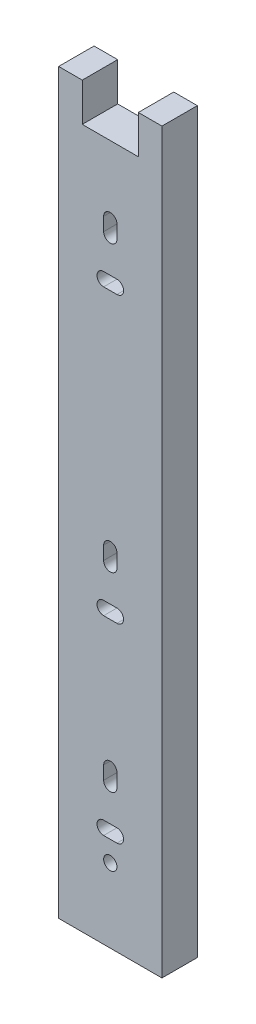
ISO-10303-21;
HEADER;
FILE_DESCRIPTION(('STEP AP214'),'2;1');
FILE_NAME('part.step','',(''),(''),'','','');
FILE_SCHEMA(('AUTOMOTIVE_DESIGN { 1 0 10303 214 1 1 1 1 }'));
ENDSEC;
DATA;
#1=APPLICATION_CONTEXT('core data for automotive mechanical design processes');
#2=APPLICATION_PROTOCOL_DEFINITION('international standard','automotive_design',2000,#1);
#3=PRODUCT_CONTEXT('',#1,'mechanical');
#4=PRODUCT('Part','Part','',(#3));
#5=PRODUCT_RELATED_PRODUCT_CATEGORY('part','',(#4));
#6=PRODUCT_DEFINITION_FORMATION('','',#4);
#7=PRODUCT_DEFINITION_CONTEXT('part definition',#1,'design');
#8=PRODUCT_DEFINITION('design','',#6,#7);
#9=PRODUCT_DEFINITION_SHAPE('','',#8);
#10=(LENGTH_UNIT() NAMED_UNIT(*) SI_UNIT(.MILLI.,.METRE.));
#11=(NAMED_UNIT(*) PLANE_ANGLE_UNIT() SI_UNIT($,.RADIAN.));
#12=(NAMED_UNIT(*) SI_UNIT($,.STERADIAN.) SOLID_ANGLE_UNIT());
#13=UNCERTAINTY_MEASURE_WITH_UNIT(LENGTH_MEASURE(1.E-05),#10,'distance_accuracy_value','');
#14=(GEOMETRIC_REPRESENTATION_CONTEXT(3) GLOBAL_UNCERTAINTY_ASSIGNED_CONTEXT((#13)) GLOBAL_UNIT_ASSIGNED_CONTEXT((#10,
#11,#12)) REPRESENTATION_CONTEXT('',''));
#15=CARTESIAN_POINT('',(0.,0.,0.));
#16=DIRECTION('',(0.,0.,1.));
#17=DIRECTION('',(1.,0.,0.));
#18=AXIS2_PLACEMENT_3D('',#15,#16,#17);
#19=CARTESIAN_POINT('',(-20.4494382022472,228.436329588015,12.));
#20=DIRECTION('',(0.,-1.,0.));
#21=DIRECTION('',(0.,0.,-1.));
#22=AXIS2_PLACEMENT_3D('',#19,#20,#21);
#23=PLANE('',#22);
#24=DIRECTION('',(0.,0.,-1.));
#25=VECTOR('',#24,1.);
#26=CARTESIAN_POINT('',(-12.4494382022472,228.436329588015,25.));
#27=LINE('',#26,#25);
#28=CARTESIAN_POINT('',(-12.4494382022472,228.436329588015,12.));
#29=VERTEX_POINT('',#28);
#30=CARTESIAN_POINT('',(-12.4494382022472,228.436329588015,0.));
#31=VERTEX_POINT('',#30);
#32=EDGE_CURVE('E385',#29,#31,#27,.T.);
#33=ORIENTED_EDGE('',*,*,#32,.T.);
#34=DIRECTION('',(-1.,0.,0.));
#35=VECTOR('',#34,1.);
#36=CARTESIAN_POINT('',(-20.4494382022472,228.436329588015,0.));
#37=LINE('',#36,#35);
#38=CARTESIAN_POINT('',(-20.4494382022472,228.436329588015,0.));
#39=VERTEX_POINT('',#38);
#40=EDGE_CURVE('E423',#31,#39,#37,.T.);
#41=ORIENTED_EDGE('',*,*,#40,.T.);
#42=DIRECTION('',(0.,0.,-1.));
#43=VECTOR('',#42,1.);
#44=CARTESIAN_POINT('',(-20.4494382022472,228.436329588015,12.));
#45=LINE('',#44,#43);
#46=CARTESIAN_POINT('',(-20.4494382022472,228.436329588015,12.));
#47=VERTEX_POINT('',#46);
#48=EDGE_CURVE('E416',#47,#39,#45,.T.);
#49=ORIENTED_EDGE('',*,*,#48,.F.);
#50=DIRECTION('',(-1.,0.,0.));
#51=VECTOR('',#50,1.);
#52=CARTESIAN_POINT('',(-20.4494382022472,228.436329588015,12.));
#53=LINE('',#52,#51);
#54=EDGE_CURVE('E412',#29,#47,#53,.T.);
#55=ORIENTED_EDGE('',*,*,#54,.F.);
#56=EDGE_LOOP('',(#33,#41,#49,#55));
#57=FACE_BOUND('',#56,.T.);
#58=ADVANCED_FACE('F32',(#57),#23,.F.);
#59=DIRECTION('',(0.,0.,-1.));
#60=VECTOR('',#59,1.);
#61=CARTESIAN_POINT('',(6.5505617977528,228.436329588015,25.));
#62=LINE('',#61,#60);
#63=CARTESIAN_POINT('',(6.5505617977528,228.436329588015,12.));
#64=VERTEX_POINT('',#63);
#65=CARTESIAN_POINT('',(6.5505617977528,228.436329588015,0.));
#66=VERTEX_POINT('',#65);
#67=EDGE_CURVE('E388',#64,#66,#62,.T.);
#68=ORIENTED_EDGE('',*,*,#67,.F.);
#69=CARTESIAN_POINT('',(14.5505617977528,228.436329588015,12.));
#70=VERTEX_POINT('',#69);
#71=EDGE_CURVE('E413',#70,#64,#53,.T.);
#72=ORIENTED_EDGE('',*,*,#71,.F.);
#73=DIRECTION('',(0.,0.,-1.));
#74=VECTOR('',#73,1.);
#75=CARTESIAN_POINT('',(14.5505617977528,228.436329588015,12.));
#76=LINE('',#75,#74);
#77=CARTESIAN_POINT('',(14.5505617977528,228.436329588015,0.));
#78=VERTEX_POINT('',#77);
#79=EDGE_CURVE('E428',#70,#78,#76,.T.);
#80=ORIENTED_EDGE('',*,*,#79,.T.);
#81=EDGE_CURVE('E408',#78,#66,#37,.T.);
#82=ORIENTED_EDGE('',*,*,#81,.T.);
#83=EDGE_LOOP('',(#68,#72,#80,#82));
#84=FACE_BOUND('',#83,.T.);
#85=ADVANCED_FACE('F523',(#84),#23,.F.);
#86=CARTESIAN_POINT('',(0.,0.,12.));
#87=DIRECTION('',(0.,0.,1.));
#88=DIRECTION('',(1.,0.,0.));
#89=AXIS2_PLACEMENT_3D('',#86,#87,#88);
#90=PLANE('',#89);
#91=CARTESIAN_POINT('',(-5.1994382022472,12.636329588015,12.));
#92=DIRECTION('',(0.,0.,1.));
#93=DIRECTION('',(1.,0.,0.));
#94=AXIS2_PLACEMENT_3D('',#91,#92,#93);
#95=CIRCLE('',#94,2.25);
#96=CARTESIAN_POINT('',(-5.1994382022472,14.886329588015,12.));
#97=VERTEX_POINT('',#96);
#98=CARTESIAN_POINT('',(-5.1994382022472,10.386329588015,12.));
#99=VERTEX_POINT('',#98);
#100=EDGE_CURVE('E47',#97,#99,#95,.T.);
#101=ORIENTED_EDGE('',*,*,#100,.F.);
#102=DIRECTION('',(-1.,0.,0.));
#103=VECTOR('',#102,1.);
#104=CARTESIAN_POINT('',(-5.1994382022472,14.886329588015,12.));
#105=LINE('',#104,#103);
#106=CARTESIAN_POINT('',(-0.699438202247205,14.886329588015,12.));
#107=VERTEX_POINT('',#106);
#108=EDGE_CURVE('E265',#107,#97,#105,.T.);
#109=ORIENTED_EDGE('',*,*,#108,.F.);
#110=CARTESIAN_POINT('',(-0.699438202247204,12.636329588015,12.));
#111=DIRECTION('',(0.,0.,1.));
#112=DIRECTION('',(1.,0.,0.));
#113=AXIS2_PLACEMENT_3D('',#110,#111,#112);
#114=CIRCLE('',#113,2.25);
#115=CARTESIAN_POINT('',(-0.699438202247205,10.386329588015,12.));
#116=VERTEX_POINT('',#115);
#117=EDGE_CURVE('E248',#116,#107,#114,.T.);
#118=ORIENTED_EDGE('',*,*,#117,.F.);
#119=DIRECTION('',(1.,0.,0.));
#120=VECTOR('',#119,1.);
#121=CARTESIAN_POINT('',(-5.1994382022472,10.386329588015,12.));
#122=LINE('',#121,#120);
#123=EDGE_CURVE('E258',#99,#116,#122,.T.);
#124=ORIENTED_EDGE('',*,*,#123,.F.);
#125=EDGE_LOOP('',(#101,#109,#118,#124));
#126=FACE_BOUND('',#125,.T.);
#127=CARTESIAN_POINT('',(-2.94943820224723,31.086329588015,12.));
#128=DIRECTION('',(0.,0.,1.));
#129=DIRECTION('',(1.,0.,0.));
#130=AXIS2_PLACEMENT_3D('',#127,#128,#129);
#131=CIRCLE('',#130,2.25);
#132=CARTESIAN_POINT('',(-0.699438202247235,31.086329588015,12.));
#133=VERTEX_POINT('',#132);
#134=CARTESIAN_POINT('',(-5.19943820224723,31.086329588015,12.));
#135=VERTEX_POINT('',#134);
#136=EDGE_CURVE('E55',#133,#135,#131,.T.);
#137=ORIENTED_EDGE('',*,*,#136,.F.);
#138=DIRECTION('',(0.,1.,0.));
#139=VECTOR('',#138,1.);
#140=CARTESIAN_POINT('',(-0.699438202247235,31.086329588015,12.));
#141=LINE('',#140,#139);
#142=CARTESIAN_POINT('',(-0.699438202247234,26.586329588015,12.));
#143=VERTEX_POINT('',#142);
#144=EDGE_CURVE('E283',#143,#133,#141,.T.);
#145=ORIENTED_EDGE('',*,*,#144,.F.);
#146=CARTESIAN_POINT('',(-2.94943820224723,26.586329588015,12.));
#147=DIRECTION('',(0.,0.,1.));
#148=DIRECTION('',(1.,0.,0.));
#149=AXIS2_PLACEMENT_3D('',#146,#147,#148);
#150=CIRCLE('',#149,2.25);
#151=CARTESIAN_POINT('',(-5.19943820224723,26.586329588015,12.));
#152=VERTEX_POINT('',#151);
#153=EDGE_CURVE('E280',#152,#143,#150,.T.);
#154=ORIENTED_EDGE('',*,*,#153,.F.);
#155=DIRECTION('',(0.,-1.,0.));
#156=VECTOR('',#155,1.);
#157=CARTESIAN_POINT('',(-5.19943820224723,31.086329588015,12.));
#158=LINE('',#157,#156);
#159=EDGE_CURVE('E276',#135,#152,#158,.T.);
#160=ORIENTED_EDGE('',*,*,#159,.F.);
#161=EDGE_LOOP('',(#137,#145,#154,#160));
#162=FACE_BOUND('',#161,.T.);
#163=CARTESIAN_POINT('',(-5.19943820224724,77.136329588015,12.));
#164=DIRECTION('',(0.,0.,1.));
#165=DIRECTION('',(1.,0.,0.));
#166=AXIS2_PLACEMENT_3D('',#163,#164,#165);
#167=CIRCLE('',#166,2.24999999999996);
#168=CARTESIAN_POINT('',(-5.19943820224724,79.3863295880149,12.));
#169=VERTEX_POINT('',#168);
#170=CARTESIAN_POINT('',(-5.19943820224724,74.886329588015,12.));
#171=VERTEX_POINT('',#170);
#172=EDGE_CURVE('E294',#169,#171,#167,.T.);
#173=ORIENTED_EDGE('',*,*,#172,.F.);
#174=DIRECTION('',(-1.,0.,0.));
#175=VECTOR('',#174,1.);
#176=CARTESIAN_POINT('',(-5.19943820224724,79.3863295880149,12.));
#177=LINE('',#176,#175);
#178=CARTESIAN_POINT('',(-0.699438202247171,79.3863295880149,12.));
#179=VERTEX_POINT('',#178);
#180=EDGE_CURVE('E303',#179,#169,#177,.T.);
#181=ORIENTED_EDGE('',*,*,#180,.F.);
#182=CARTESIAN_POINT('',(-0.699438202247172,77.136329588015,12.));
#183=DIRECTION('',(0.,0.,1.));
#184=DIRECTION('',(1.,0.,0.));
#185=AXIS2_PLACEMENT_3D('',#182,#183,#184);
#186=CIRCLE('',#185,2.24999999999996);
#187=CARTESIAN_POINT('',(-0.699438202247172,74.886329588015,12.));
#188=VERTEX_POINT('',#187);
#189=EDGE_CURVE('E300',#188,#179,#186,.T.);
#190=ORIENTED_EDGE('',*,*,#189,.F.);
#191=DIRECTION('',(1.,0.,0.));
#192=VECTOR('',#191,1.);
#193=CARTESIAN_POINT('',(-5.19943820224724,74.886329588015,12.));
#194=LINE('',#193,#192);
#195=EDGE_CURVE('E296',#171,#188,#194,.T.);
#196=ORIENTED_EDGE('',*,*,#195,.F.);
#197=EDGE_LOOP('',(#173,#181,#190,#196));
#198=FACE_BOUND('',#197,.T.);
#199=CARTESIAN_POINT('',(-2.94943820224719,95.5863295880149,12.));
#200=DIRECTION('',(0.,0.,1.));
#201=DIRECTION('',(1.,0.,0.));
#202=AXIS2_PLACEMENT_3D('',#199,#200,#201);
#203=CIRCLE('',#202,2.25);
#204=CARTESIAN_POINT('',(-0.699438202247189,95.5863295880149,12.));
#205=VERTEX_POINT('',#204);
#206=CARTESIAN_POINT('',(-5.19943820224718,95.5863295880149,12.));
#207=VERTEX_POINT('',#206);
#208=EDGE_CURVE('E314',#205,#207,#203,.T.);
#209=ORIENTED_EDGE('',*,*,#208,.F.);
#210=DIRECTION('',(0.,1.,0.));
#211=VECTOR('',#210,1.);
#212=CARTESIAN_POINT('',(-0.699438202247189,95.5863295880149,12.));
#213=LINE('',#212,#211);
#214=CARTESIAN_POINT('',(-0.69943820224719,91.0863295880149,12.));
#215=VERTEX_POINT('',#214);
#216=EDGE_CURVE('E323',#215,#205,#213,.T.);
#217=ORIENTED_EDGE('',*,*,#216,.F.);
#218=CARTESIAN_POINT('',(-2.94943820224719,91.0863295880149,12.));
#219=DIRECTION('',(0.,0.,1.));
#220=DIRECTION('',(1.,0.,0.));
#221=AXIS2_PLACEMENT_3D('',#218,#219,#220);
#222=CIRCLE('',#221,2.25);
#223=CARTESIAN_POINT('',(-5.19943820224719,91.0863295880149,12.));
#224=VERTEX_POINT('',#223);
#225=EDGE_CURVE('E320',#224,#215,#222,.T.);
#226=ORIENTED_EDGE('',*,*,#225,.F.);
#227=DIRECTION('',(0.,-1.,0.));
#228=VECTOR('',#227,1.);
#229=CARTESIAN_POINT('',(-5.19943820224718,95.5863295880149,12.));
#230=LINE('',#229,#228);
#231=EDGE_CURVE('E316',#207,#224,#230,.T.);
#232=ORIENTED_EDGE('',*,*,#231,.F.);
#233=EDGE_LOOP('',(#209,#217,#226,#232));
#234=FACE_BOUND('',#233,.T.);
#235=CARTESIAN_POINT('',(-5.19943820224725,173.636329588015,12.));
#236=DIRECTION('',(0.,0.,1.));
#237=DIRECTION('',(1.,0.,0.));
#238=AXIS2_PLACEMENT_3D('',#235,#236,#237);
#239=CIRCLE('',#238,2.24999999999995);
#240=CARTESIAN_POINT('',(-5.19943820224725,175.886329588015,12.));
#241=VERTEX_POINT('',#240);
#242=CARTESIAN_POINT('',(-5.19943820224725,171.386329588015,12.));
#243=VERTEX_POINT('',#242);
#244=EDGE_CURVE('E334',#241,#243,#239,.T.);
#245=ORIENTED_EDGE('',*,*,#244,.F.);
#246=DIRECTION('',(-1.,0.,0.));
#247=VECTOR('',#246,1.);
#248=CARTESIAN_POINT('',(-5.19943820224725,175.886329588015,12.));
#249=LINE('',#248,#247);
#250=CARTESIAN_POINT('',(-0.699438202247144,175.886329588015,12.));
#251=VERTEX_POINT('',#250);
#252=EDGE_CURVE('E343',#251,#241,#249,.T.);
#253=ORIENTED_EDGE('',*,*,#252,.F.);
#254=CARTESIAN_POINT('',(-0.699438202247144,173.636329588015,12.));
#255=DIRECTION('',(0.,0.,1.));
#256=DIRECTION('',(1.,0.,0.));
#257=AXIS2_PLACEMENT_3D('',#254,#255,#256);
#258=CIRCLE('',#257,2.24999999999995);
#259=CARTESIAN_POINT('',(-0.699438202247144,171.386329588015,12.));
#260=VERTEX_POINT('',#259);
#261=EDGE_CURVE('E340',#260,#251,#258,.T.);
#262=ORIENTED_EDGE('',*,*,#261,.F.);
#263=DIRECTION('',(1.,0.,0.));
#264=VECTOR('',#263,1.);
#265=CARTESIAN_POINT('',(-5.19943820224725,171.386329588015,12.));
#266=LINE('',#265,#264);
#267=EDGE_CURVE('E336',#243,#260,#266,.T.);
#268=ORIENTED_EDGE('',*,*,#267,.F.);
#269=EDGE_LOOP('',(#245,#253,#262,#268));
#270=FACE_BOUND('',#269,.T.);
#271=CARTESIAN_POINT('',(-2.94943820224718,192.086329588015,12.));
#272=DIRECTION('',(0.,0.,1.));
#273=DIRECTION('',(1.,0.,0.));
#274=AXIS2_PLACEMENT_3D('',#271,#272,#273);
#275=CIRCLE('',#274,2.25000000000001);
#276=CARTESIAN_POINT('',(-0.699438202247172,192.086329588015,12.));
#277=VERTEX_POINT('',#276);
#278=CARTESIAN_POINT('',(-5.19943820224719,192.086329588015,12.));
#279=VERTEX_POINT('',#278);
#280=EDGE_CURVE('E354',#277,#279,#275,.T.);
#281=ORIENTED_EDGE('',*,*,#280,.F.);
#282=DIRECTION('',(0.,1.,0.));
#283=VECTOR('',#282,1.);
#284=CARTESIAN_POINT('',(-0.699438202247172,192.086329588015,12.));
#285=LINE('',#284,#283);
#286=CARTESIAN_POINT('',(-0.699438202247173,187.586329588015,12.));
#287=VERTEX_POINT('',#286);
#288=EDGE_CURVE('E362',#287,#277,#285,.T.);
#289=ORIENTED_EDGE('',*,*,#288,.F.);
#290=CARTESIAN_POINT('',(-2.94943820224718,187.586329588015,12.));
#291=DIRECTION('',(0.,0.,1.));
#292=DIRECTION('',(1.,0.,0.));
#293=AXIS2_PLACEMENT_3D('',#290,#291,#292);
#294=CIRCLE('',#293,2.25000000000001);
#295=CARTESIAN_POINT('',(-5.19943820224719,187.586329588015,12.));
#296=VERTEX_POINT('',#295);
#297=EDGE_CURVE('E359',#296,#287,#294,.T.);
#298=ORIENTED_EDGE('',*,*,#297,.F.);
#299=DIRECTION('',(0.,-1.,0.));
#300=VECTOR('',#299,1.);
#301=CARTESIAN_POINT('',(-5.19943820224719,192.086329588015,12.));
#302=LINE('',#301,#300);
#303=EDGE_CURVE('E356',#279,#296,#302,.T.);
#304=ORIENTED_EDGE('',*,*,#303,.F.);
#305=EDGE_LOOP('',(#281,#289,#298,#304));
#306=FACE_BOUND('',#305,.T.);
#307=CARTESIAN_POINT('',(-2.94943820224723,3.43632958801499,12.));
#308=DIRECTION('',(0.,0.,1.));
#309=DIRECTION('',(1.,0.,0.));
#310=AXIS2_PLACEMENT_3D('',#307,#308,#309);
#311=CIRCLE('',#310,2.25);
#312=CARTESIAN_POINT('',(-0.699438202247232,3.43632958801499,12.));
#313=VERTEX_POINT('',#312);
#314=EDGE_CURVE('E272',#313,#313,#311,.T.);
#315=ORIENTED_EDGE('',*,*,#314,.F.);
#316=EDGE_LOOP('',(#315));
#317=FACE_BOUND('',#316,.T.);
#318=DIRECTION('',(-1.,0.,0.));
#319=VECTOR('',#318,1.);
#320=CARTESIAN_POINT('',(0.,215.436329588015,12.));
#321=LINE('',#320,#319);
#322=CARTESIAN_POINT('',(6.5505617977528,215.436329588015,12.));
#323=VERTEX_POINT('',#322);
#324=CARTESIAN_POINT('',(-12.4494382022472,215.436329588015,12.));
#325=VERTEX_POINT('',#324);
#326=EDGE_CURVE('E397',#323,#325,#321,.T.);
#327=ORIENTED_EDGE('',*,*,#326,.T.);
#328=DIRECTION('',(0.,1.,0.));
#329=VECTOR('',#328,1.);
#330=CARTESIAN_POINT('',(-12.4494382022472,0.,12.));
#331=LINE('',#330,#329);
#332=EDGE_CURVE('E400',#325,#29,#331,.T.);
#333=ORIENTED_EDGE('',*,*,#332,.T.);
#334=ORIENTED_EDGE('',*,*,#54,.T.);
#335=DIRECTION('',(0.,-1.,0.));
#336=VECTOR('',#335,1.);
#337=CARTESIAN_POINT('',(-20.4494382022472,228.436329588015,12.));
#338=LINE('',#337,#336);
#339=CARTESIAN_POINT('',(-20.4494382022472,-21.563670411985,12.));
#340=VERTEX_POINT('',#339);
#341=EDGE_CURVE('E404',#47,#340,#338,.T.);
#342=ORIENTED_EDGE('',*,*,#341,.T.);
#343=DIRECTION('',(1.,0.,0.));
#344=VECTOR('',#343,1.);
#345=CARTESIAN_POINT('',(-20.4494382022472,-21.563670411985,12.));
#346=LINE('',#345,#344);
#347=CARTESIAN_POINT('',(14.5505617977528,-21.563670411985,12.));
#348=VERTEX_POINT('',#347);
#349=EDGE_CURVE('E407',#340,#348,#346,.T.);
#350=ORIENTED_EDGE('',*,*,#349,.T.);
#351=DIRECTION('',(0.,1.,0.));
#352=VECTOR('',#351,1.);
#353=CARTESIAN_POINT('',(14.5505617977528,228.436329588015,12.));
#354=LINE('',#353,#352);
#355=EDGE_CURVE('E410',#348,#70,#354,.T.);
#356=ORIENTED_EDGE('',*,*,#355,.T.);
#357=ORIENTED_EDGE('',*,*,#71,.T.);
#358=DIRECTION('',(0.,-1.,0.));
#359=VECTOR('',#358,1.);
#360=CARTESIAN_POINT('',(6.55056179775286,0.,12.));
#361=LINE('',#360,#359);
#362=EDGE_CURVE('E394',#64,#323,#361,.T.);
#363=ORIENTED_EDGE('',*,*,#362,.T.);
#364=EDGE_LOOP('',(#327,#333,#334,#342,#350,#356,#357,#363));
#365=FACE_BOUND('',#364,.T.);
#366=ADVANCED_FACE('F262',(#126,#162,#198,#234,#270,#306,#317,#365),#90,.T.);
#367=CARTESIAN_POINT('',(0.,0.,0.));
#368=DIRECTION('',(0.,0.,1.));
#369=DIRECTION('',(1.,0.,0.));
#370=AXIS2_PLACEMENT_3D('',#367,#368,#369);
#371=PLANE('',#370);
#372=DIRECTION('',(-1.,0.,0.));
#373=VECTOR('',#372,1.);
#374=CARTESIAN_POINT('',(0.,14.886329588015,0.));
#375=LINE('',#374,#373);
#376=CARTESIAN_POINT('',(-0.699438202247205,14.886329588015,0.));
#377=VERTEX_POINT('',#376);
#378=CARTESIAN_POINT('',(-5.1994382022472,14.886329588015,0.));
#379=VERTEX_POINT('',#378);
#380=EDGE_CURVE('E40',#377,#379,#375,.T.);
#381=ORIENTED_EDGE('',*,*,#380,.T.);
#382=CARTESIAN_POINT('',(-5.1994382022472,12.636329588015,0.));
#383=DIRECTION('',(0.,0.,1.));
#384=DIRECTION('',(1.,0.,0.));
#385=AXIS2_PLACEMENT_3D('',#382,#383,#384);
#386=CIRCLE('',#385,2.25);
#387=CARTESIAN_POINT('',(-5.1994382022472,10.386329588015,0.));
#388=VERTEX_POINT('',#387);
#389=EDGE_CURVE('E11',#379,#388,#386,.T.);
#390=ORIENTED_EDGE('',*,*,#389,.T.);
#391=DIRECTION('',(1.,0.,0.));
#392=VECTOR('',#391,1.);
#393=CARTESIAN_POINT('',(0.,10.386329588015,0.));
#394=LINE('',#393,#392);
#395=CARTESIAN_POINT('',(-0.699438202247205,10.386329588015,0.));
#396=VERTEX_POINT('',#395);
#397=EDGE_CURVE('E499',#388,#396,#394,.T.);
#398=ORIENTED_EDGE('',*,*,#397,.T.);
#399=CARTESIAN_POINT('',(-0.699438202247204,12.636329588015,0.));
#400=DIRECTION('',(0.,0.,1.));
#401=DIRECTION('',(1.,0.,0.));
#402=AXIS2_PLACEMENT_3D('',#399,#400,#401);
#403=CIRCLE('',#402,2.25);
#404=EDGE_CURVE('E251',#396,#377,#403,.T.);
#405=ORIENTED_EDGE('',*,*,#404,.T.);
#406=EDGE_LOOP('',(#381,#390,#398,#405));
#407=FACE_BOUND('',#406,.T.);
#408=DIRECTION('',(0.,1.,0.));
#409=VECTOR('',#408,1.);
#410=CARTESIAN_POINT('',(-0.699438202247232,0.,0.));
#411=LINE('',#410,#409);
#412=CARTESIAN_POINT('',(-0.699438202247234,26.586329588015,0.));
#413=VERTEX_POINT('',#412);
#414=CARTESIAN_POINT('',(-0.699438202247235,31.086329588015,0.));
#415=VERTEX_POINT('',#414);
#416=EDGE_CURVE('E493',#413,#415,#411,.T.);
#417=ORIENTED_EDGE('',*,*,#416,.T.);
#418=CARTESIAN_POINT('',(-2.94943820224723,31.086329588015,0.));
#419=DIRECTION('',(0.,0.,1.));
#420=DIRECTION('',(1.,0.,0.));
#421=AXIS2_PLACEMENT_3D('',#418,#419,#420);
#422=CIRCLE('',#421,2.25);
#423=CARTESIAN_POINT('',(-5.19943820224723,31.086329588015,0.));
#424=VERTEX_POINT('',#423);
#425=EDGE_CURVE('E496',#415,#424,#422,.T.);
#426=ORIENTED_EDGE('',*,*,#425,.T.);
#427=DIRECTION('',(0.,-1.,0.));
#428=VECTOR('',#427,1.);
#429=CARTESIAN_POINT('',(-5.19943820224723,0.,0.));
#430=LINE('',#429,#428);
#431=CARTESIAN_POINT('',(-5.19943820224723,26.586329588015,0.));
#432=VERTEX_POINT('',#431);
#433=EDGE_CURVE('E487',#424,#432,#430,.T.);
#434=ORIENTED_EDGE('',*,*,#433,.T.);
#435=CARTESIAN_POINT('',(-2.94943820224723,26.586329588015,0.));
#436=DIRECTION('',(0.,0.,1.));
#437=DIRECTION('',(1.,0.,0.));
#438=AXIS2_PLACEMENT_3D('',#435,#436,#437);
#439=CIRCLE('',#438,2.25);
#440=EDGE_CURVE('E490',#432,#413,#439,.T.);
#441=ORIENTED_EDGE('',*,*,#440,.T.);
#442=EDGE_LOOP('',(#417,#426,#434,#441));
#443=FACE_BOUND('',#442,.T.);
#444=DIRECTION('',(-1.,0.,0.));
#445=VECTOR('',#444,1.);
#446=CARTESIAN_POINT('',(0.,79.3863295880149,0.));
#447=LINE('',#446,#445);
#448=CARTESIAN_POINT('',(-0.699438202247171,79.3863295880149,0.));
#449=VERTEX_POINT('',#448);
#450=CARTESIAN_POINT('',(-5.19943820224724,79.3863295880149,0.));
#451=VERTEX_POINT('',#450);
#452=EDGE_CURVE('E481',#449,#451,#447,.T.);
#453=ORIENTED_EDGE('',*,*,#452,.T.);
#454=CARTESIAN_POINT('',(-5.19943820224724,77.136329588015,0.));
#455=DIRECTION('',(0.,0.,1.));
#456=DIRECTION('',(1.,0.,0.));
#457=AXIS2_PLACEMENT_3D('',#454,#455,#456);
#458=CIRCLE('',#457,2.24999999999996);
#459=CARTESIAN_POINT('',(-5.19943820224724,74.886329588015,0.));
#460=VERTEX_POINT('',#459);
#461=EDGE_CURVE('E484',#451,#460,#458,.T.);
#462=ORIENTED_EDGE('',*,*,#461,.T.);
#463=DIRECTION('',(1.,0.,0.));
#464=VECTOR('',#463,1.);
#465=CARTESIAN_POINT('',(0.,74.886329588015,0.));
#466=LINE('',#465,#464);
#467=CARTESIAN_POINT('',(-0.699438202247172,74.886329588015,0.));
#468=VERTEX_POINT('',#467);
#469=EDGE_CURVE('E475',#460,#468,#466,.T.);
#470=ORIENTED_EDGE('',*,*,#469,.T.);
#471=CARTESIAN_POINT('',(-0.699438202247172,77.136329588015,0.));
#472=DIRECTION('',(0.,0.,1.));
#473=DIRECTION('',(1.,0.,0.));
#474=AXIS2_PLACEMENT_3D('',#471,#472,#473);
#475=CIRCLE('',#474,2.24999999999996);
#476=EDGE_CURVE('E478',#468,#449,#475,.T.);
#477=ORIENTED_EDGE('',*,*,#476,.T.);
#478=EDGE_LOOP('',(#453,#462,#470,#477));
#479=FACE_BOUND('',#478,.T.);
#480=DIRECTION('',(0.,1.,0.));
#481=VECTOR('',#480,1.);
#482=CARTESIAN_POINT('',(-0.699438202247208,0.,0.));
#483=LINE('',#482,#481);
#484=CARTESIAN_POINT('',(-0.69943820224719,91.0863295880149,0.));
#485=VERTEX_POINT('',#484);
#486=CARTESIAN_POINT('',(-0.699438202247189,95.5863295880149,0.));
#487=VERTEX_POINT('',#486);
#488=EDGE_CURVE('E469',#485,#487,#483,.T.);
#489=ORIENTED_EDGE('',*,*,#488,.T.);
#490=CARTESIAN_POINT('',(-2.94943820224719,95.5863295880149,0.));
#491=DIRECTION('',(0.,0.,1.));
#492=DIRECTION('',(1.,0.,0.));
#493=AXIS2_PLACEMENT_3D('',#490,#491,#492);
#494=CIRCLE('',#493,2.25);
#495=CARTESIAN_POINT('',(-5.19943820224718,95.5863295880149,0.));
#496=VERTEX_POINT('',#495);
#497=EDGE_CURVE('E472',#487,#496,#494,.T.);
#498=ORIENTED_EDGE('',*,*,#497,.T.);
#499=DIRECTION('',(0.,-1.,0.));
#500=VECTOR('',#499,1.);
#501=CARTESIAN_POINT('',(-5.1994382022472,0.,0.));
#502=LINE('',#501,#500);
#503=CARTESIAN_POINT('',(-5.19943820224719,91.0863295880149,0.));
#504=VERTEX_POINT('',#503);
#505=EDGE_CURVE('E463',#496,#504,#502,.T.);
#506=ORIENTED_EDGE('',*,*,#505,.T.);
#507=CARTESIAN_POINT('',(-2.94943820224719,91.0863295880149,0.));
#508=DIRECTION('',(0.,0.,1.));
#509=DIRECTION('',(1.,0.,0.));
#510=AXIS2_PLACEMENT_3D('',#507,#508,#509);
#511=CIRCLE('',#510,2.25);
#512=EDGE_CURVE('E466',#504,#485,#511,.T.);
#513=ORIENTED_EDGE('',*,*,#512,.T.);
#514=EDGE_LOOP('',(#489,#498,#506,#513));
#515=FACE_BOUND('',#514,.T.);
#516=DIRECTION('',(-1.,0.,0.));
#517=VECTOR('',#516,1.);
#518=CARTESIAN_POINT('',(0.,175.886329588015,0.));
#519=LINE('',#518,#517);
#520=CARTESIAN_POINT('',(-0.699438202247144,175.886329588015,0.));
#521=VERTEX_POINT('',#520);
#522=CARTESIAN_POINT('',(-5.19943820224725,175.886329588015,0.));
#523=VERTEX_POINT('',#522);
#524=EDGE_CURVE('E457',#521,#523,#519,.T.);
#525=ORIENTED_EDGE('',*,*,#524,.T.);
#526=CARTESIAN_POINT('',(-5.19943820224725,173.636329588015,0.));
#527=DIRECTION('',(0.,0.,1.));
#528=DIRECTION('',(1.,0.,0.));
#529=AXIS2_PLACEMENT_3D('',#526,#527,#528);
#530=CIRCLE('',#529,2.24999999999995);
#531=CARTESIAN_POINT('',(-5.19943820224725,171.386329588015,0.));
#532=VERTEX_POINT('',#531);
#533=EDGE_CURVE('E460',#523,#532,#530,.T.);
#534=ORIENTED_EDGE('',*,*,#533,.T.);
#535=DIRECTION('',(1.,0.,0.));
#536=VECTOR('',#535,1.);
#537=CARTESIAN_POINT('',(0.,171.386329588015,0.));
#538=LINE('',#537,#536);
#539=CARTESIAN_POINT('',(-0.699438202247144,171.386329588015,0.));
#540=VERTEX_POINT('',#539);
#541=EDGE_CURVE('E451',#532,#540,#538,.T.);
#542=ORIENTED_EDGE('',*,*,#541,.T.);
#543=CARTESIAN_POINT('',(-0.699438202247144,173.636329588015,0.));
#544=DIRECTION('',(0.,0.,1.));
#545=DIRECTION('',(1.,0.,0.));
#546=AXIS2_PLACEMENT_3D('',#543,#544,#545);
#547=CIRCLE('',#546,2.24999999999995);
#548=EDGE_CURVE('E454',#540,#521,#547,.T.);
#549=ORIENTED_EDGE('',*,*,#548,.T.);
#550=EDGE_LOOP('',(#525,#534,#542,#549));
#551=FACE_BOUND('',#550,.T.);
#552=DIRECTION('',(0.,1.,0.));
#553=VECTOR('',#552,1.);
#554=CARTESIAN_POINT('',(-0.699438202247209,0.,0.));
#555=LINE('',#554,#553);
#556=CARTESIAN_POINT('',(-0.699438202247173,187.586329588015,0.));
#557=VERTEX_POINT('',#556);
#558=CARTESIAN_POINT('',(-0.699438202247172,192.086329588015,0.));
#559=VERTEX_POINT('',#558);
#560=EDGE_CURVE('E445',#557,#559,#555,.T.);
#561=ORIENTED_EDGE('',*,*,#560,.T.);
#562=CARTESIAN_POINT('',(-2.94943820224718,192.086329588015,0.));
#563=DIRECTION('',(0.,0.,1.));
#564=DIRECTION('',(1.,0.,0.));
#565=AXIS2_PLACEMENT_3D('',#562,#563,#564);
#566=CIRCLE('',#565,2.25000000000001);
#567=CARTESIAN_POINT('',(-5.19943820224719,192.086329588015,0.));
#568=VERTEX_POINT('',#567);
#569=EDGE_CURVE('E448',#559,#568,#566,.T.);
#570=ORIENTED_EDGE('',*,*,#569,.T.);
#571=DIRECTION('',(0.,-1.,0.));
#572=VECTOR('',#571,1.);
#573=CARTESIAN_POINT('',(-5.19943820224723,0.,0.));
#574=LINE('',#573,#572);
#575=CARTESIAN_POINT('',(-5.19943820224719,187.586329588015,0.));
#576=VERTEX_POINT('',#575);
#577=EDGE_CURVE('E437',#568,#576,#574,.T.);
#578=ORIENTED_EDGE('',*,*,#577,.T.);
#579=CARTESIAN_POINT('',(-2.94943820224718,187.586329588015,0.));
#580=DIRECTION('',(0.,0.,1.));
#581=DIRECTION('',(1.,0.,0.));
#582=AXIS2_PLACEMENT_3D('',#579,#580,#581);
#583=CIRCLE('',#582,2.25000000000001);
#584=EDGE_CURVE('E442',#576,#557,#583,.T.);
#585=ORIENTED_EDGE('',*,*,#584,.T.);
#586=EDGE_LOOP('',(#561,#570,#578,#585));
#587=FACE_BOUND('',#586,.T.);
#588=CARTESIAN_POINT('',(-2.94943820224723,3.43632958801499,0.));
#589=DIRECTION('',(0.,0.,1.));
#590=DIRECTION('',(1.,0.,0.));
#591=AXIS2_PLACEMENT_3D('',#588,#589,#590);
#592=CIRCLE('',#591,2.25);
#593=CARTESIAN_POINT('',(-0.699438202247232,3.43632958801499,0.));
#594=VERTEX_POINT('',#593);
#595=EDGE_CURVE('E375',#594,#594,#592,.T.);
#596=ORIENTED_EDGE('',*,*,#595,.T.);
#597=EDGE_LOOP('',(#596));
#598=FACE_BOUND('',#597,.T.);
#599=DIRECTION('',(0.,-1.,0.));
#600=VECTOR('',#599,1.);
#601=CARTESIAN_POINT('',(-12.4494382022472,228.436329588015,0.));
#602=LINE('',#601,#600);
#603=CARTESIAN_POINT('',(-12.4494382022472,215.436329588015,0.));
#604=VERTEX_POINT('',#603);
#605=EDGE_CURVE('E376',#31,#604,#602,.T.);
#606=ORIENTED_EDGE('',*,*,#605,.T.);
#607=DIRECTION('',(1.,0.,0.));
#608=VECTOR('',#607,1.);
#609=CARTESIAN_POINT('',(-12.4494382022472,215.436329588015,0.));
#610=LINE('',#609,#608);
#611=CARTESIAN_POINT('',(6.5505617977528,215.436329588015,0.));
#612=VERTEX_POINT('',#611);
#613=EDGE_CURVE('E379',#604,#612,#610,.T.);
#614=ORIENTED_EDGE('',*,*,#613,.T.);
#615=DIRECTION('',(0.,1.,0.));
#616=VECTOR('',#615,1.);
#617=CARTESIAN_POINT('',(6.5505617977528,228.436329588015,0.));
#618=LINE('',#617,#616);
#619=EDGE_CURVE('E382',#612,#66,#618,.T.);
#620=ORIENTED_EDGE('',*,*,#619,.T.);
#621=ORIENTED_EDGE('',*,*,#81,.F.);
#622=DIRECTION('',(0.,1.,0.));
#623=VECTOR('',#622,1.);
#624=CARTESIAN_POINT('',(14.5505617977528,228.436329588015,0.));
#625=LINE('',#624,#623);
#626=CARTESIAN_POINT('',(14.5505617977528,-21.563670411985,0.));
#627=VERTEX_POINT('',#626);
#628=EDGE_CURVE('E421',#627,#78,#625,.T.);
#629=ORIENTED_EDGE('',*,*,#628,.F.);
#630=DIRECTION('',(1.,0.,0.));
#631=VECTOR('',#630,1.);
#632=CARTESIAN_POINT('',(-20.4494382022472,-21.563670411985,0.));
#633=LINE('',#632,#631);
#634=CARTESIAN_POINT('',(-20.4494382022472,-21.563670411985,0.));
#635=VERTEX_POINT('',#634);
#636=EDGE_CURVE('E419',#635,#627,#633,.T.);
#637=ORIENTED_EDGE('',*,*,#636,.F.);
#638=DIRECTION('',(0.,-1.,0.));
#639=VECTOR('',#638,1.);
#640=CARTESIAN_POINT('',(-20.4494382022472,228.436329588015,0.));
#641=LINE('',#640,#639);
#642=EDGE_CURVE('E403',#39,#635,#641,.T.);
#643=ORIENTED_EDGE('',*,*,#642,.F.);
#644=ORIENTED_EDGE('',*,*,#40,.F.);
#645=EDGE_LOOP('',(#606,#614,#620,#621,#629,#637,#643,#644));
#646=FACE_BOUND('',#645,.T.);
#647=ADVANCED_FACE('F503',(#407,#443,#479,#515,#551,#587,#598,#646),#371,.F.);
#648=CARTESIAN_POINT('',(-20.4494382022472,228.436329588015,12.));
#649=DIRECTION('',(1.,0.,0.));
#650=DIRECTION('',(0.,1.,0.));
#651=AXIS2_PLACEMENT_3D('',#648,#649,#650);
#652=PLANE('',#651);
#653=ORIENTED_EDGE('',*,*,#642,.T.);
#654=DIRECTION('',(0.,0.,-1.));
#655=VECTOR('',#654,1.);
#656=CARTESIAN_POINT('',(-20.4494382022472,-21.563670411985,12.));
#657=LINE('',#656,#655);
#658=EDGE_CURVE('E434',#340,#635,#657,.T.);
#659=ORIENTED_EDGE('',*,*,#658,.F.);
#660=ORIENTED_EDGE('',*,*,#341,.F.);
#661=ORIENTED_EDGE('',*,*,#48,.T.);
#662=EDGE_LOOP('',(#653,#659,#660,#661));
#663=FACE_BOUND('',#662,.T.);
#664=ADVANCED_FACE('F34',(#663),#652,.F.);
#665=CARTESIAN_POINT('',(-20.4494382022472,-21.563670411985,12.));
#666=DIRECTION('',(0.,1.,0.));
#667=DIRECTION('',(0.,0.,1.));
#668=AXIS2_PLACEMENT_3D('',#665,#666,#667);
#669=PLANE('',#668);
#670=ORIENTED_EDGE('',*,*,#636,.T.);
#671=DIRECTION('',(0.,0.,-1.));
#672=VECTOR('',#671,1.);
#673=CARTESIAN_POINT('',(14.5505617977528,-21.563670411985,12.));
#674=LINE('',#673,#672);
#675=EDGE_CURVE('E431',#348,#627,#674,.T.);
#676=ORIENTED_EDGE('',*,*,#675,.F.);
#677=ORIENTED_EDGE('',*,*,#349,.F.);
#678=ORIENTED_EDGE('',*,*,#658,.T.);
#679=EDGE_LOOP('',(#670,#676,#677,#678));
#680=FACE_BOUND('',#679,.T.);
#681=ADVANCED_FACE('F536',(#680),#669,.F.);
#682=CARTESIAN_POINT('',(14.5505617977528,228.436329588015,12.));
#683=DIRECTION('',(-1.,0.,0.));
#684=DIRECTION('',(0.,-1.,0.));
#685=AXIS2_PLACEMENT_3D('',#682,#683,#684);
#686=PLANE('',#685);
#687=ORIENTED_EDGE('',*,*,#628,.T.);
#688=ORIENTED_EDGE('',*,*,#79,.F.);
#689=ORIENTED_EDGE('',*,*,#355,.F.);
#690=ORIENTED_EDGE('',*,*,#675,.T.);
#691=EDGE_LOOP('',(#687,#688,#689,#690));
#692=FACE_BOUND('',#691,.T.);
#693=ADVANCED_FACE('F533',(#692),#686,.F.);
#694=CARTESIAN_POINT('',(-12.4494382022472,228.436329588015,25.));
#695=DIRECTION('',(1.,0.,0.));
#696=DIRECTION('',(0.,1.,0.));
#697=AXIS2_PLACEMENT_3D('',#694,#695,#696);
#698=PLANE('',#697);
#699=DIRECTION('',(0.,0.,-1.));
#700=VECTOR('',#699,1.);
#701=CARTESIAN_POINT('',(-12.4494382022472,215.436329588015,25.));
#702=LINE('',#701,#700);
#703=EDGE_CURVE('E392',#325,#604,#702,.T.);
#704=ORIENTED_EDGE('',*,*,#703,.T.);
#705=ORIENTED_EDGE('',*,*,#605,.F.);
#706=ORIENTED_EDGE('',*,*,#32,.F.);
#707=ORIENTED_EDGE('',*,*,#332,.F.);
#708=EDGE_LOOP('',(#704,#705,#706,#707));
#709=FACE_BOUND('',#708,.T.);
#710=ADVANCED_FACE('F535',(#709),#698,.T.);
#711=CARTESIAN_POINT('',(-12.4494382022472,215.436329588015,25.));
#712=DIRECTION('',(0.,1.,0.));
#713=DIRECTION('',(0.,0.,1.));
#714=AXIS2_PLACEMENT_3D('',#711,#712,#713);
#715=PLANE('',#714);
#716=DIRECTION('',(0.,0.,-1.));
#717=VECTOR('',#716,1.);
#718=CARTESIAN_POINT('',(6.5505617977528,215.436329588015,25.));
#719=LINE('',#718,#717);
#720=EDGE_CURVE('E390',#323,#612,#719,.T.);
#721=ORIENTED_EDGE('',*,*,#720,.T.);
#722=ORIENTED_EDGE('',*,*,#613,.F.);
#723=ORIENTED_EDGE('',*,*,#703,.F.);
#724=ORIENTED_EDGE('',*,*,#326,.F.);
#725=EDGE_LOOP('',(#721,#722,#723,#724));
#726=FACE_BOUND('',#725,.T.);
#727=ADVANCED_FACE('F564',(#726),#715,.T.);
#728=CARTESIAN_POINT('',(6.5505617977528,228.436329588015,25.));
#729=DIRECTION('',(-1.,0.,0.));
#730=DIRECTION('',(0.,-1.,0.));
#731=AXIS2_PLACEMENT_3D('',#728,#729,#730);
#732=PLANE('',#731);
#733=ORIENTED_EDGE('',*,*,#67,.T.);
#734=ORIENTED_EDGE('',*,*,#619,.F.);
#735=ORIENTED_EDGE('',*,*,#720,.F.);
#736=ORIENTED_EDGE('',*,*,#362,.F.);
#737=EDGE_LOOP('',(#733,#734,#735,#736));
#738=FACE_BOUND('',#737,.T.);
#739=ADVANCED_FACE('F567',(#738),#732,.T.);
#740=CARTESIAN_POINT('',(-2.94943820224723,3.43632958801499,-9.00000000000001));
#741=DIRECTION('',(0.,0.,1.));
#742=DIRECTION('',(1.,0.,0.));
#743=AXIS2_PLACEMENT_3D('',#740,#741,#742);
#744=CYLINDRICAL_SURFACE('',#743,2.25);
#745=ORIENTED_EDGE('',*,*,#314,.T.);
#746=EDGE_LOOP('',(#745));
#747=FACE_BOUND('',#746,.T.);
#748=ORIENTED_EDGE('',*,*,#595,.F.);
#749=EDGE_LOOP('',(#748));
#750=FACE_BOUND('',#749,.T.);
#751=ADVANCED_FACE('F569',(#747,#750),#744,.F.);
#752=CARTESIAN_POINT('',(-2.94943820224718,192.086329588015,-9.00000000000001));
#753=DIRECTION('',(0.,0.,1.));
#754=DIRECTION('',(1.,0.,0.));
#755=AXIS2_PLACEMENT_3D('',#752,#753,#754);
#756=CYLINDRICAL_SURFACE('',#755,2.25000000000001);
#757=DIRECTION('',(0.,0.,1.));
#758=VECTOR('',#757,1.);
#759=CARTESIAN_POINT('',(-0.699438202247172,192.086329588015,-9.00000000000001));
#760=LINE('',#759,#758);
#761=EDGE_CURVE('E337',#559,#277,#760,.T.);
#762=ORIENTED_EDGE('',*,*,#761,.T.);
#763=ORIENTED_EDGE('',*,*,#280,.T.);
#764=DIRECTION('',(0.,0.,1.));
#765=VECTOR('',#764,1.);
#766=CARTESIAN_POINT('',(-5.19943820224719,192.086329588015,-9.00000000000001));
#767=LINE('',#766,#765);
#768=EDGE_CURVE('E365',#568,#279,#767,.T.);
#769=ORIENTED_EDGE('',*,*,#768,.F.);
#770=ORIENTED_EDGE('',*,*,#569,.F.);
#771=EDGE_LOOP('',(#762,#763,#769,#770));
#772=FACE_BOUND('',#771,.T.);
#773=ADVANCED_FACE('F575',(#772),#756,.F.);
#774=CARTESIAN_POINT('',(-0.699438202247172,192.086329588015,-9.00000000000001));
#775=DIRECTION('',(1.,0.,0.));
#776=DIRECTION('',(0.,1.,0.));
#777=AXIS2_PLACEMENT_3D('',#774,#775,#776);
#778=PLANE('',#777);
#779=DIRECTION('',(0.,0.,1.));
#780=VECTOR('',#779,1.);
#781=CARTESIAN_POINT('',(-0.699438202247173,187.586329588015,-9.00000000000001));
#782=LINE('',#781,#780);
#783=EDGE_CURVE('E367',#557,#287,#782,.T.);
#784=ORIENTED_EDGE('',*,*,#783,.T.);
#785=ORIENTED_EDGE('',*,*,#288,.T.);
#786=ORIENTED_EDGE('',*,*,#761,.F.);
#787=ORIENTED_EDGE('',*,*,#560,.F.);
#788=EDGE_LOOP('',(#784,#785,#786,#787));
#789=FACE_BOUND('',#788,.T.);
#790=ADVANCED_FACE('F649',(#789),#778,.F.);
#791=CARTESIAN_POINT('',(-2.94943820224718,187.586329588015,-9.00000000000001));
#792=DIRECTION('',(0.,0.,1.));
#793=DIRECTION('',(1.,0.,0.));
#794=AXIS2_PLACEMENT_3D('',#791,#792,#793);
#795=CYLINDRICAL_SURFACE('',#794,2.25000000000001);
#796=DIRECTION('',(0.,0.,1.));
#797=VECTOR('',#796,1.);
#798=CARTESIAN_POINT('',(-5.19943820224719,187.586329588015,-9.00000000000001));
#799=LINE('',#798,#797);
#800=EDGE_CURVE('E369',#576,#296,#799,.T.);
#801=ORIENTED_EDGE('',*,*,#800,.T.);
#802=ORIENTED_EDGE('',*,*,#297,.T.);
#803=ORIENTED_EDGE('',*,*,#783,.F.);
#804=ORIENTED_EDGE('',*,*,#584,.F.);
#805=EDGE_LOOP('',(#801,#802,#803,#804));
#806=FACE_BOUND('',#805,.T.);
#807=ADVANCED_FACE('F657',(#806),#795,.F.);
#808=CARTESIAN_POINT('',(-5.19943820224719,192.086329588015,-9.00000000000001));
#809=DIRECTION('',(-1.,0.,0.));
#810=DIRECTION('',(0.,-1.,0.));
#811=AXIS2_PLACEMENT_3D('',#808,#809,#810);
#812=PLANE('',#811);
#813=ORIENTED_EDGE('',*,*,#768,.T.);
#814=ORIENTED_EDGE('',*,*,#303,.T.);
#815=ORIENTED_EDGE('',*,*,#800,.F.);
#816=ORIENTED_EDGE('',*,*,#577,.F.);
#817=EDGE_LOOP('',(#813,#814,#815,#816));
#818=FACE_BOUND('',#817,.T.);
#819=ADVANCED_FACE('F666',(#818),#812,.F.);
#820=CARTESIAN_POINT('',(-5.19943820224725,173.636329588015,-9.00000000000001));
#821=DIRECTION('',(0.,0.,1.));
#822=DIRECTION('',(1.,0.,0.));
#823=AXIS2_PLACEMENT_3D('',#820,#821,#822);
#824=CYLINDRICAL_SURFACE('',#823,2.24999999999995);
#825=DIRECTION('',(0.,0.,1.));
#826=VECTOR('',#825,1.);
#827=CARTESIAN_POINT('',(-5.19943820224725,175.886329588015,-9.00000000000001));
#828=LINE('',#827,#826);
#829=EDGE_CURVE('E317',#523,#241,#828,.T.);
#830=ORIENTED_EDGE('',*,*,#829,.T.);
#831=ORIENTED_EDGE('',*,*,#244,.T.);
#832=DIRECTION('',(0.,0.,1.));
#833=VECTOR('',#832,1.);
#834=CARTESIAN_POINT('',(-5.19943820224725,171.386329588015,-9.00000000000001));
#835=LINE('',#834,#833);
#836=EDGE_CURVE('E346',#532,#243,#835,.T.);
#837=ORIENTED_EDGE('',*,*,#836,.F.);
#838=ORIENTED_EDGE('',*,*,#533,.F.);
#839=EDGE_LOOP('',(#830,#831,#837,#838));
#840=FACE_BOUND('',#839,.T.);
#841=ADVANCED_FACE('F675',(#840),#824,.F.);
#842=CARTESIAN_POINT('',(-5.19943820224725,175.886329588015,-9.00000000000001));
#843=DIRECTION('',(0.,1.,0.));
#844=DIRECTION('',(0.,0.,1.));
#845=AXIS2_PLACEMENT_3D('',#842,#843,#844);
#846=PLANE('',#845);
#847=DIRECTION('',(0.,0.,1.));
#848=VECTOR('',#847,1.);
#849=CARTESIAN_POINT('',(-0.699438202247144,175.886329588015,-9.00000000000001));
#850=LINE('',#849,#848);
#851=EDGE_CURVE('E348',#521,#251,#850,.T.);
#852=ORIENTED_EDGE('',*,*,#851,.T.);
#853=ORIENTED_EDGE('',*,*,#252,.T.);
#854=ORIENTED_EDGE('',*,*,#829,.F.);
#855=ORIENTED_EDGE('',*,*,#524,.F.);
#856=EDGE_LOOP('',(#852,#853,#854,#855));
#857=FACE_BOUND('',#856,.T.);
#858=ADVANCED_FACE('F684',(#857),#846,.F.);
#859=CARTESIAN_POINT('',(-0.699438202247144,173.636329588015,-9.00000000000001));
#860=DIRECTION('',(0.,0.,1.));
#861=DIRECTION('',(1.,0.,0.));
#862=AXIS2_PLACEMENT_3D('',#859,#860,#861);
#863=CYLINDRICAL_SURFACE('',#862,2.24999999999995);
#864=DIRECTION('',(0.,0.,1.));
#865=VECTOR('',#864,1.);
#866=CARTESIAN_POINT('',(-0.699438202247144,171.386329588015,-9.00000000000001));
#867=LINE('',#866,#865);
#868=EDGE_CURVE('E350',#540,#260,#867,.T.);
#869=ORIENTED_EDGE('',*,*,#868,.T.);
#870=ORIENTED_EDGE('',*,*,#261,.T.);
#871=ORIENTED_EDGE('',*,*,#851,.F.);
#872=ORIENTED_EDGE('',*,*,#548,.F.);
#873=EDGE_LOOP('',(#869,#870,#871,#872));
#874=FACE_BOUND('',#873,.T.);
#875=ADVANCED_FACE('F693',(#874),#863,.F.);
#876=CARTESIAN_POINT('',(-5.19943820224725,171.386329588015,-9.00000000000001));
#877=DIRECTION('',(0.,-1.,0.));
#878=DIRECTION('',(0.,0.,-1.));
#879=AXIS2_PLACEMENT_3D('',#876,#877,#878);
#880=PLANE('',#879);
#881=ORIENTED_EDGE('',*,*,#836,.T.);
#882=ORIENTED_EDGE('',*,*,#267,.T.);
#883=ORIENTED_EDGE('',*,*,#868,.F.);
#884=ORIENTED_EDGE('',*,*,#541,.F.);
#885=EDGE_LOOP('',(#881,#882,#883,#884));
#886=FACE_BOUND('',#885,.T.);
#887=ADVANCED_FACE('F702',(#886),#880,.F.);
#888=CARTESIAN_POINT('',(-2.94943820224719,95.5863295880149,-9.00000000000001));
#889=DIRECTION('',(0.,0.,1.));
#890=DIRECTION('',(1.,0.,0.));
#891=AXIS2_PLACEMENT_3D('',#888,#889,#890);
#892=CYLINDRICAL_SURFACE('',#891,2.25);
#893=DIRECTION('',(0.,0.,1.));
#894=VECTOR('',#893,1.);
#895=CARTESIAN_POINT('',(-0.699438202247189,95.5863295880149,-9.00000000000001));
#896=LINE('',#895,#894);
#897=EDGE_CURVE('E297',#487,#205,#896,.T.);
#898=ORIENTED_EDGE('',*,*,#897,.T.);
#899=ORIENTED_EDGE('',*,*,#208,.T.);
#900=DIRECTION('',(0.,0.,1.));
#901=VECTOR('',#900,1.);
#902=CARTESIAN_POINT('',(-5.19943820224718,95.5863295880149,-9.00000000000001));
#903=LINE('',#902,#901);
#904=EDGE_CURVE('E326',#496,#207,#903,.T.);
#905=ORIENTED_EDGE('',*,*,#904,.F.);
#906=ORIENTED_EDGE('',*,*,#497,.F.);
#907=EDGE_LOOP('',(#898,#899,#905,#906));
#908=FACE_BOUND('',#907,.T.);
#909=ADVANCED_FACE('F711',(#908),#892,.F.);
#910=CARTESIAN_POINT('',(-0.699438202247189,95.5863295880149,-9.00000000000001));
#911=DIRECTION('',(1.,0.,0.));
#912=DIRECTION('',(0.,1.,0.));
#913=AXIS2_PLACEMENT_3D('',#910,#911,#912);
#914=PLANE('',#913);
#915=DIRECTION('',(0.,0.,1.));
#916=VECTOR('',#915,1.);
#917=CARTESIAN_POINT('',(-0.69943820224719,91.0863295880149,-9.00000000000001));
#918=LINE('',#917,#916);
#919=EDGE_CURVE('E328',#485,#215,#918,.T.);
#920=ORIENTED_EDGE('',*,*,#919,.T.);
#921=ORIENTED_EDGE('',*,*,#216,.T.);
#922=ORIENTED_EDGE('',*,*,#897,.F.);
#923=ORIENTED_EDGE('',*,*,#488,.F.);
#924=EDGE_LOOP('',(#920,#921,#922,#923));
#925=FACE_BOUND('',#924,.T.);
#926=ADVANCED_FACE('F720',(#925),#914,.F.);
#927=CARTESIAN_POINT('',(-2.94943820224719,91.0863295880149,-9.00000000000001));
#928=DIRECTION('',(0.,0.,1.));
#929=DIRECTION('',(1.,0.,0.));
#930=AXIS2_PLACEMENT_3D('',#927,#928,#929);
#931=CYLINDRICAL_SURFACE('',#930,2.25);
#932=DIRECTION('',(0.,0.,1.));
#933=VECTOR('',#932,1.);
#934=CARTESIAN_POINT('',(-5.19943820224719,91.0863295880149,-9.00000000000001));
#935=LINE('',#934,#933);
#936=EDGE_CURVE('E330',#504,#224,#935,.T.);
#937=ORIENTED_EDGE('',*,*,#936,.T.);
#938=ORIENTED_EDGE('',*,*,#225,.T.);
#939=ORIENTED_EDGE('',*,*,#919,.F.);
#940=ORIENTED_EDGE('',*,*,#512,.F.);
#941=EDGE_LOOP('',(#937,#938,#939,#940));
#942=FACE_BOUND('',#941,.T.);
#943=ADVANCED_FACE('F729',(#942),#931,.F.);
#944=CARTESIAN_POINT('',(-5.19943820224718,95.5863295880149,-9.00000000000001));
#945=DIRECTION('',(-1.,0.,0.));
#946=DIRECTION('',(0.,-1.,0.));
#947=AXIS2_PLACEMENT_3D('',#944,#945,#946);
#948=PLANE('',#947);
#949=ORIENTED_EDGE('',*,*,#904,.T.);
#950=ORIENTED_EDGE('',*,*,#231,.T.);
#951=ORIENTED_EDGE('',*,*,#936,.F.);
#952=ORIENTED_EDGE('',*,*,#505,.F.);
#953=EDGE_LOOP('',(#949,#950,#951,#952));
#954=FACE_BOUND('',#953,.T.);
#955=ADVANCED_FACE('F738',(#954),#948,.F.);
#956=CARTESIAN_POINT('',(-5.19943820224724,77.136329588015,-9.00000000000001));
#957=DIRECTION('',(0.,0.,1.));
#958=DIRECTION('',(1.,0.,0.));
#959=AXIS2_PLACEMENT_3D('',#956,#957,#958);
#960=CYLINDRICAL_SURFACE('',#959,2.24999999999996);
#961=DIRECTION('',(0.,0.,1.));
#962=VECTOR('',#961,1.);
#963=CARTESIAN_POINT('',(-5.19943820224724,79.3863295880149,-9.00000000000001));
#964=LINE('',#963,#962);
#965=EDGE_CURVE('E277',#451,#169,#964,.T.);
#966=ORIENTED_EDGE('',*,*,#965,.T.);
#967=ORIENTED_EDGE('',*,*,#172,.T.);
#968=DIRECTION('',(0.,0.,1.));
#969=VECTOR('',#968,1.);
#970=CARTESIAN_POINT('',(-5.19943820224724,74.886329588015,-9.00000000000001));
#971=LINE('',#970,#969);
#972=EDGE_CURVE('E306',#460,#171,#971,.T.);
#973=ORIENTED_EDGE('',*,*,#972,.F.);
#974=ORIENTED_EDGE('',*,*,#461,.F.);
#975=EDGE_LOOP('',(#966,#967,#973,#974));
#976=FACE_BOUND('',#975,.T.);
#977=ADVANCED_FACE('F747',(#976),#960,.F.);
#978=CARTESIAN_POINT('',(-5.19943820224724,79.3863295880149,-9.00000000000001));
#979=DIRECTION('',(0.,1.,0.));
#980=DIRECTION('',(0.,0.,1.));
#981=AXIS2_PLACEMENT_3D('',#978,#979,#980);
#982=PLANE('',#981);
#983=DIRECTION('',(0.,0.,1.));
#984=VECTOR('',#983,1.);
#985=CARTESIAN_POINT('',(-0.699438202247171,79.3863295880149,-9.00000000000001));
#986=LINE('',#985,#984);
#987=EDGE_CURVE('E308',#449,#179,#986,.T.);
#988=ORIENTED_EDGE('',*,*,#987,.T.);
#989=ORIENTED_EDGE('',*,*,#180,.T.);
#990=ORIENTED_EDGE('',*,*,#965,.F.);
#991=ORIENTED_EDGE('',*,*,#452,.F.);
#992=EDGE_LOOP('',(#988,#989,#990,#991));
#993=FACE_BOUND('',#992,.T.);
#994=ADVANCED_FACE('F756',(#993),#982,.F.);
#995=CARTESIAN_POINT('',(-0.699438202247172,77.136329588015,-9.00000000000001));
#996=DIRECTION('',(0.,0.,1.));
#997=DIRECTION('',(1.,0.,0.));
#998=AXIS2_PLACEMENT_3D('',#995,#996,#997);
#999=CYLINDRICAL_SURFACE('',#998,2.24999999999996);
#1000=DIRECTION('',(0.,0.,1.));
#1001=VECTOR('',#1000,1.);
#1002=CARTESIAN_POINT('',(-0.699438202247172,74.886329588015,-9.00000000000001));
#1003=LINE('',#1002,#1001);
#1004=EDGE_CURVE('E310',#468,#188,#1003,.T.);
#1005=ORIENTED_EDGE('',*,*,#1004,.T.);
#1006=ORIENTED_EDGE('',*,*,#189,.T.);
#1007=ORIENTED_EDGE('',*,*,#987,.F.);
#1008=ORIENTED_EDGE('',*,*,#476,.F.);
#1009=EDGE_LOOP('',(#1005,#1006,#1007,#1008));
#1010=FACE_BOUND('',#1009,.T.);
#1011=ADVANCED_FACE('F765',(#1010),#999,.F.);
#1012=CARTESIAN_POINT('',(-5.19943820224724,74.886329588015,-9.00000000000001));
#1013=DIRECTION('',(0.,-1.,0.));
#1014=DIRECTION('',(0.,0.,-1.));
#1015=AXIS2_PLACEMENT_3D('',#1012,#1013,#1014);
#1016=PLANE('',#1015);
#1017=ORIENTED_EDGE('',*,*,#972,.T.);
#1018=ORIENTED_EDGE('',*,*,#195,.T.);
#1019=ORIENTED_EDGE('',*,*,#1004,.F.);
#1020=ORIENTED_EDGE('',*,*,#469,.F.);
#1021=EDGE_LOOP('',(#1017,#1018,#1019,#1020));
#1022=FACE_BOUND('',#1021,.T.);
#1023=ADVANCED_FACE('F774',(#1022),#1016,.F.);
#1024=CARTESIAN_POINT('',(-2.94943820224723,31.086329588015,-9.00000000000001));
#1025=DIRECTION('',(0.,0.,1.));
#1026=DIRECTION('',(1.,0.,0.));
#1027=AXIS2_PLACEMENT_3D('',#1024,#1025,#1026);
#1028=CYLINDRICAL_SURFACE('',#1027,2.25);
#1029=DIRECTION('',(0.,0.,1.));
#1030=VECTOR('',#1029,1.);
#1031=CARTESIAN_POINT('',(-0.699438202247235,31.086329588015,-9.00000000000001));
#1032=LINE('',#1031,#1030);
#1033=EDGE_CURVE('E287',#415,#133,#1032,.T.);
#1034=ORIENTED_EDGE('',*,*,#1033,.T.);
#1035=ORIENTED_EDGE('',*,*,#136,.T.);
#1036=DIRECTION('',(0.,0.,1.));
#1037=VECTOR('',#1036,1.);
#1038=CARTESIAN_POINT('',(-5.19943820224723,31.086329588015,-9.00000000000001));
#1039=LINE('',#1038,#1037);
#1040=EDGE_CURVE('E286',#424,#135,#1039,.T.);
#1041=ORIENTED_EDGE('',*,*,#1040,.F.);
#1042=ORIENTED_EDGE('',*,*,#425,.F.);
#1043=EDGE_LOOP('',(#1034,#1035,#1041,#1042));
#1044=FACE_BOUND('',#1043,.T.);
#1045=ADVANCED_FACE('F783',(#1044),#1028,.F.);
#1046=CARTESIAN_POINT('',(-0.699438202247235,31.086329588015,-9.00000000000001));
#1047=DIRECTION('',(1.,0.,0.));
#1048=DIRECTION('',(0.,1.,0.));
#1049=AXIS2_PLACEMENT_3D('',#1046,#1047,#1048);
#1050=PLANE('',#1049);
#1051=DIRECTION('',(0.,0.,1.));
#1052=VECTOR('',#1051,1.);
#1053=CARTESIAN_POINT('',(-0.699438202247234,26.586329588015,-9.00000000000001));
#1054=LINE('',#1053,#1052);
#1055=EDGE_CURVE('E289',#413,#143,#1054,.T.);
#1056=ORIENTED_EDGE('',*,*,#1055,.T.);
#1057=ORIENTED_EDGE('',*,*,#144,.T.);
#1058=ORIENTED_EDGE('',*,*,#1033,.F.);
#1059=ORIENTED_EDGE('',*,*,#416,.F.);
#1060=EDGE_LOOP('',(#1056,#1057,#1058,#1059));
#1061=FACE_BOUND('',#1060,.T.);
#1062=ADVANCED_FACE('F792',(#1061),#1050,.F.);
#1063=CARTESIAN_POINT('',(-2.94943820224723,26.586329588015,-9.00000000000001));
#1064=DIRECTION('',(0.,0.,1.));
#1065=DIRECTION('',(1.,0.,0.));
#1066=AXIS2_PLACEMENT_3D('',#1063,#1064,#1065);
#1067=CYLINDRICAL_SURFACE('',#1066,2.25);
#1068=DIRECTION('',(0.,0.,1.));
#1069=VECTOR('',#1068,1.);
#1070=CARTESIAN_POINT('',(-5.19943820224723,26.586329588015,-9.00000000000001));
#1071=LINE('',#1070,#1069);
#1072=EDGE_CURVE('E291',#432,#152,#1071,.T.);
#1073=ORIENTED_EDGE('',*,*,#1072,.T.);
#1074=ORIENTED_EDGE('',*,*,#153,.T.);
#1075=ORIENTED_EDGE('',*,*,#1055,.F.);
#1076=ORIENTED_EDGE('',*,*,#440,.F.);
#1077=EDGE_LOOP('',(#1073,#1074,#1075,#1076));
#1078=FACE_BOUND('',#1077,.T.);
#1079=ADVANCED_FACE('F517',(#1078),#1067,.F.);
#1080=CARTESIAN_POINT('',(-5.19943820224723,31.086329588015,-9.00000000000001));
#1081=DIRECTION('',(-1.,0.,0.));
#1082=DIRECTION('',(0.,0.,1.));
#1083=AXIS2_PLACEMENT_3D('',#1080,#1081,#1082);
#1084=PLANE('',#1083);
#1085=ORIENTED_EDGE('',*,*,#1040,.T.);
#1086=ORIENTED_EDGE('',*,*,#159,.T.);
#1087=ORIENTED_EDGE('',*,*,#1072,.F.);
#1088=ORIENTED_EDGE('',*,*,#433,.F.);
#1089=EDGE_LOOP('',(#1085,#1086,#1087,#1088));
#1090=FACE_BOUND('',#1089,.T.);
#1091=ADVANCED_FACE('F510',(#1090),#1084,.F.);
#1092=CARTESIAN_POINT('',(-5.1994382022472,12.636329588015,-9.00000000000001));
#1093=DIRECTION('',(0.,0.,1.));
#1094=DIRECTION('',(1.,0.,0.));
#1095=AXIS2_PLACEMENT_3D('',#1092,#1093,#1094);
#1096=CYLINDRICAL_SURFACE('',#1095,2.25);
#1097=DIRECTION('',(0.,0.,1.));
#1098=VECTOR('',#1097,1.);
#1099=CARTESIAN_POINT('',(-5.1994382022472,14.886329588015,-9.00000000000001));
#1100=LINE('',#1099,#1098);
#1101=EDGE_CURVE('E270',#379,#97,#1100,.T.);
#1102=ORIENTED_EDGE('',*,*,#1101,.T.);
#1103=ORIENTED_EDGE('',*,*,#100,.T.);
#1104=DIRECTION('',(0.,0.,1.));
#1105=VECTOR('',#1104,1.);
#1106=CARTESIAN_POINT('',(-5.1994382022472,10.386329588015,-9.00000000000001));
#1107=LINE('',#1106,#1105);
#1108=EDGE_CURVE('E255',#388,#99,#1107,.T.);
#1109=ORIENTED_EDGE('',*,*,#1108,.F.);
#1110=ORIENTED_EDGE('',*,*,#389,.F.);
#1111=EDGE_LOOP('',(#1102,#1103,#1109,#1110));
#1112=FACE_BOUND('',#1111,.T.);
#1113=ADVANCED_FACE('F508',(#1112),#1096,.F.);
#1114=CARTESIAN_POINT('',(-5.1994382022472,14.886329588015,-9.00000000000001));
#1115=DIRECTION('',(0.,1.,0.));
#1116=DIRECTION('',(0.,0.,1.));
#1117=AXIS2_PLACEMENT_3D('',#1114,#1115,#1116);
#1118=PLANE('',#1117);
#1119=DIRECTION('',(0.,0.,1.));
#1120=VECTOR('',#1119,1.);
#1121=CARTESIAN_POINT('',(-0.699438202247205,14.886329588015,-9.00000000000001));
#1122=LINE('',#1121,#1120);
#1123=EDGE_CURVE('E254',#377,#107,#1122,.T.);
#1124=ORIENTED_EDGE('',*,*,#1123,.T.);
#1125=ORIENTED_EDGE('',*,*,#108,.T.);
#1126=ORIENTED_EDGE('',*,*,#1101,.F.);
#1127=ORIENTED_EDGE('',*,*,#380,.F.);
#1128=EDGE_LOOP('',(#1124,#1125,#1126,#1127));
#1129=FACE_BOUND('',#1128,.T.);
#1130=ADVANCED_FACE('F507',(#1129),#1118,.F.);
#1131=CARTESIAN_POINT('',(-0.699438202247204,12.636329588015,-9.00000000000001));
#1132=DIRECTION('',(0.,0.,1.));
#1133=DIRECTION('',(1.,0.,0.));
#1134=AXIS2_PLACEMENT_3D('',#1131,#1132,#1133);
#1135=CYLINDRICAL_SURFACE('',#1134,2.25);
#1136=DIRECTION('',(0.,0.,1.));
#1137=VECTOR('',#1136,1.);
#1138=CARTESIAN_POINT('',(-0.699438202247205,10.386329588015,-9.00000000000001));
#1139=LINE('',#1138,#1137);
#1140=EDGE_CURVE('E243',#396,#116,#1139,.T.);
#1141=ORIENTED_EDGE('',*,*,#1140,.T.);
#1142=ORIENTED_EDGE('',*,*,#117,.T.);
#1143=ORIENTED_EDGE('',*,*,#1123,.F.);
#1144=ORIENTED_EDGE('',*,*,#404,.F.);
#1145=EDGE_LOOP('',(#1141,#1142,#1143,#1144));
#1146=FACE_BOUND('',#1145,.T.);
#1147=ADVANCED_FACE('F245',(#1146),#1135,.F.);
#1148=CARTESIAN_POINT('',(-5.1994382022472,10.386329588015,-9.00000000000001));
#1149=DIRECTION('',(0.,-1.,0.));
#1150=DIRECTION('',(0.,0.,-1.));
#1151=AXIS2_PLACEMENT_3D('',#1148,#1149,#1150);
#1152=PLANE('',#1151);
#1153=ORIENTED_EDGE('',*,*,#1108,.T.);
#1154=ORIENTED_EDGE('',*,*,#123,.T.);
#1155=ORIENTED_EDGE('',*,*,#1140,.F.);
#1156=ORIENTED_EDGE('',*,*,#397,.F.);
#1157=EDGE_LOOP('',(#1153,#1154,#1155,#1156));
#1158=FACE_BOUND('',#1157,.T.);
#1159=ADVANCED_FACE('F259',(#1158),#1152,.F.);
#1160=CLOSED_SHELL('',(#58,#85,#366,#647,#664,#681,#693,#710,#727,#739,#751,#773,#790,#807,#819,
#841,#858,#875,#887,#909,#926,#943,#955,#977,#994,#1011,#1023,#1045,#1062,#1079,#1091,#1113,
#1130,#1147,#1159));
#1161=MANIFOLD_SOLID_BREP('B2',#1160);
#1162=ADVANCED_BREP_SHAPE_REPRESENTATION('',(#18,#1161),#14);
#1163=SHAPE_DEFINITION_REPRESENTATION(#9,#1162);
ENDSEC;
END-ISO-10303-21;
